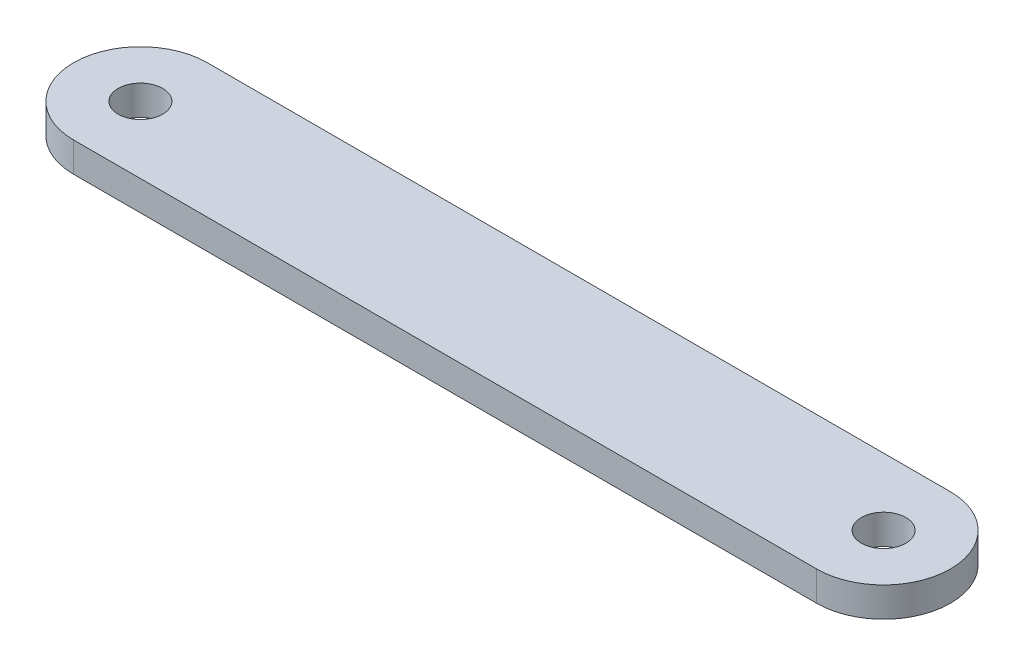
from build123d import *

# Parameters (mm, degrees)
BOSS_EXTRUDE1_DEPTH = 2
SKETCH2_R           = 1.5
CUT_EXTRUDE1_DEPTH  = 2


with BuildPart() as part:
    # Sketch1 → Boss-Extrude1 (new body)
    with BuildSketch(Plane(origin=(0, 0, 0), x_dir=(1, 0, 0), z_dir=(0, 1, 0))):
        with BuildLine():
            Line((-25, 4.5), (25, 4.5))
            ThreePointArc((25, 4.5), (29.5, 0), (25, -4.5))
            Line((25, -4.5), (-25, -4.5))
            ThreePointArc((-25, -4.5), (-29.5, 0), (-25, 4.5))
        make_face()
    extrude(amount=BOSS_EXTRUDE1_DEPTH)

    # Sketch2 → Cut-Extrude1 (cut)
    with BuildSketch(Plane(origin=(0, 2, 0), x_dir=(1, 0, 0), z_dir=(0, 1, 0))):
        with Locations(Location((-25, 0, 0), (0, 0, 270))):
            Circle(SKETCH2_R)
        with Locations(Location((25, 0, 0), (0, 0, 270))):
            Circle(SKETCH2_R)
    extrude(amount=-CUT_EXTRUDE1_DEPTH, mode=Mode.SUBTRACT)


solid = part.part
